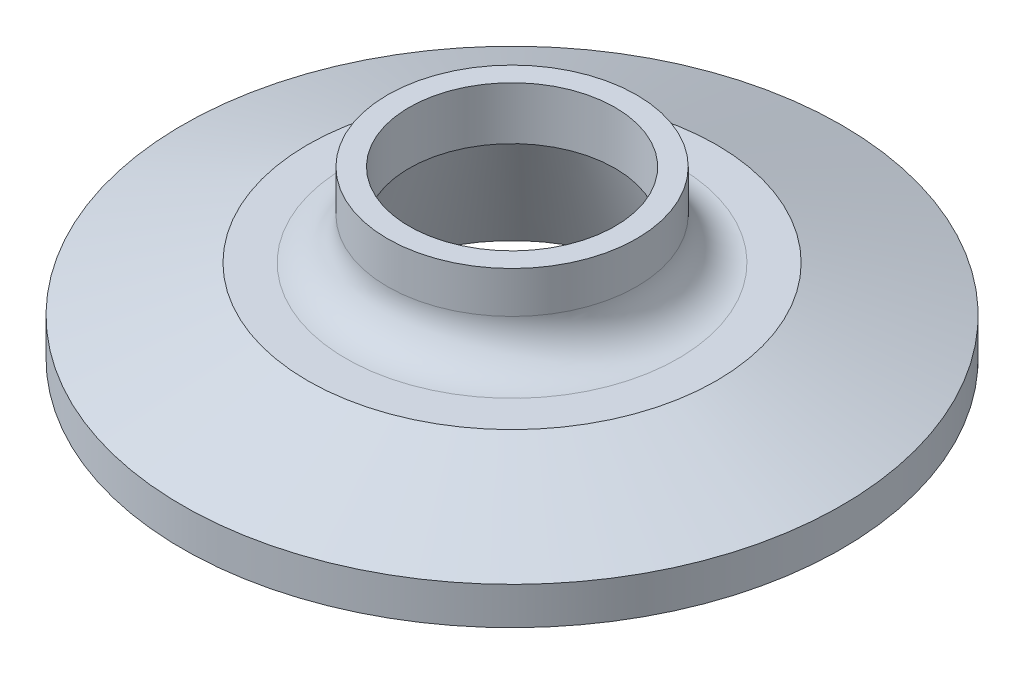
ISO-10303-21;
HEADER;
FILE_DESCRIPTION(('STEP AP214'),'2;1');
FILE_NAME('part.step','',(''),(''),'','','');
FILE_SCHEMA(('AUTOMOTIVE_DESIGN { 1 0 10303 214 1 1 1 1 }'));
ENDSEC;
DATA;
#1=APPLICATION_CONTEXT('core data for automotive mechanical design processes');
#2=APPLICATION_PROTOCOL_DEFINITION('international standard','automotive_design',2000,#1);
#3=PRODUCT_CONTEXT('',#1,'mechanical');
#4=PRODUCT('Part','Part','',(#3));
#5=PRODUCT_RELATED_PRODUCT_CATEGORY('part','',(#4));
#6=PRODUCT_DEFINITION_FORMATION('','',#4);
#7=PRODUCT_DEFINITION_CONTEXT('part definition',#1,'design');
#8=PRODUCT_DEFINITION('design','',#6,#7);
#9=PRODUCT_DEFINITION_SHAPE('','',#8);
#10=(LENGTH_UNIT() NAMED_UNIT(*) SI_UNIT(.MILLI.,.METRE.));
#11=(NAMED_UNIT(*) PLANE_ANGLE_UNIT() SI_UNIT($,.RADIAN.));
#12=(NAMED_UNIT(*) SI_UNIT($,.STERADIAN.) SOLID_ANGLE_UNIT());
#13=UNCERTAINTY_MEASURE_WITH_UNIT(LENGTH_MEASURE(1.E-05),#10,'distance_accuracy_value','');
#14=(GEOMETRIC_REPRESENTATION_CONTEXT(3) GLOBAL_UNCERTAINTY_ASSIGNED_CONTEXT((#13)) GLOBAL_UNIT_ASSIGNED_CONTEXT((#10,
#11,#12)) REPRESENTATION_CONTEXT('',''));
#15=CARTESIAN_POINT('',(0.,0.,0.));
#16=DIRECTION('',(0.,0.,1.));
#17=DIRECTION('',(1.,0.,0.));
#18=AXIS2_PLACEMENT_3D('',#15,#16,#17);
#19=CARTESIAN_POINT('',(-7.874,12.7,0.));
#20=DIRECTION('',(0.,-1.,0.));
#21=DIRECTION('',(0.,0.,-1.));
#22=AXIS2_PLACEMENT_3D('',#19,#20,#21);
#23=PLANE('',#22);
#24=CARTESIAN_POINT('',(0.,12.7,0.));
#25=DIRECTION('',(0.,-1.,0.));
#26=DIRECTION('',(0.,0.,-1.));
#27=AXIS2_PLACEMENT_3D('',#24,#25,#26);
#28=CIRCLE('',#27,9.525);
#29=CARTESIAN_POINT('',(0.,12.7,-9.525));
#30=VERTEX_POINT('',#29);
#31=EDGE_CURVE('E12',#30,#30,#28,.T.);
#32=ORIENTED_EDGE('',*,*,#31,.F.);
#33=EDGE_LOOP('',(#32));
#34=FACE_BOUND('',#33,.T.);
#35=CARTESIAN_POINT('',(0.,12.7,0.));
#36=DIRECTION('',(0.,-1.,0.));
#37=DIRECTION('',(0.,0.,-1.));
#38=AXIS2_PLACEMENT_3D('',#35,#36,#37);
#39=CIRCLE('',#38,7.874);
#40=CARTESIAN_POINT('',(0.,12.7,-7.874));
#41=VERTEX_POINT('',#40);
#42=EDGE_CURVE('E87',#41,#41,#39,.T.);
#43=ORIENTED_EDGE('',*,*,#42,.T.);
#44=EDGE_LOOP('',(#43));
#45=FACE_BOUND('',#44,.T.);
#46=ADVANCED_FACE('F38',(#34,#45),#23,.F.);
#47=CARTESIAN_POINT('',(0.,0.,0.));
#48=DIRECTION('',(0.,-1.,0.));
#49=DIRECTION('',(0.,0.,-1.));
#50=AXIS2_PLACEMENT_3D('',#47,#48,#49);
#51=CYLINDRICAL_SURFACE('',#50,9.525);
#52=CARTESIAN_POINT('',(0.,9.525,0.));
#53=DIRECTION('',(0.,-1.,0.));
#54=DIRECTION('',(0.,0.,-1.));
#55=AXIS2_PLACEMENT_3D('',#52,#53,#54);
#56=CIRCLE('',#55,9.525);
#57=CARTESIAN_POINT('',(0.,9.525,-9.525));
#58=VERTEX_POINT('',#57);
#59=EDGE_CURVE('E44',#58,#58,#56,.T.);
#60=ORIENTED_EDGE('',*,*,#59,.F.);
#61=EDGE_LOOP('',(#60));
#62=FACE_BOUND('',#61,.T.);
#63=ORIENTED_EDGE('',*,*,#31,.T.);
#64=EDGE_LOOP('',(#63));
#65=FACE_BOUND('',#64,.T.);
#66=ADVANCED_FACE('F166',(#62,#65),#51,.T.);
#67=CARTESIAN_POINT('',(0.,9.525,0.));
#68=DIRECTION('',(0.,-1.,0.));
#69=DIRECTION('',(0.,0.,-1.));
#70=AXIS2_PLACEMENT_3D('',#67,#68,#69);
#71=TOROIDAL_SURFACE('',#70,12.7,3.175);
#72=CARTESIAN_POINT('',(0.,6.35,0.));
#73=DIRECTION('',(0.,-1.,0.));
#74=DIRECTION('',(0.,0.,-1.));
#75=AXIS2_PLACEMENT_3D('',#72,#73,#74);
#76=CIRCLE('',#75,12.7);
#77=CARTESIAN_POINT('',(0.,6.35,-12.7));
#78=VERTEX_POINT('',#77);
#79=EDGE_CURVE('E48',#78,#78,#76,.T.);
#80=ORIENTED_EDGE('',*,*,#79,.F.);
#81=EDGE_LOOP('',(#80));
#82=FACE_BOUND('',#81,.T.);
#83=ORIENTED_EDGE('',*,*,#59,.T.);
#84=EDGE_LOOP('',(#83));
#85=FACE_BOUND('',#84,.T.);
#86=ADVANCED_FACE('F161',(#82,#85),#71,.F.);
#87=CARTESIAN_POINT('',(-12.7,6.35,0.));
#88=DIRECTION('',(0.,-1.,0.));
#89=DIRECTION('',(0.,0.,-1.));
#90=AXIS2_PLACEMENT_3D('',#87,#88,#89);
#91=PLANE('',#90);
#92=CARTESIAN_POINT('',(0.,6.35,0.));
#93=DIRECTION('',(0.,-1.,0.));
#94=DIRECTION('',(0.,0.,-1.));
#95=AXIS2_PLACEMENT_3D('',#92,#93,#94);
#96=CIRCLE('',#95,15.6301961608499);
#97=CARTESIAN_POINT('',(0.,6.35,-15.6301961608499));
#98=VERTEX_POINT('',#97);
#99=EDGE_CURVE('E52',#98,#98,#96,.T.);
#100=ORIENTED_EDGE('',*,*,#99,.F.);
#101=EDGE_LOOP('',(#100));
#102=FACE_BOUND('',#101,.T.);
#103=ORIENTED_EDGE('',*,*,#79,.T.);
#104=EDGE_LOOP('',(#103));
#105=FACE_BOUND('',#104,.T.);
#106=ADVANCED_FACE('F155',(#102,#105),#91,.F.);
#107=CARTESIAN_POINT('',(0.,6.35,0.));
#108=DIRECTION('',(0.,-1.,0.));
#109=DIRECTION('',(0.,0.,-1.));
#110=AXIS2_PLACEMENT_3D('',#107,#108,#109);
#111=CONICAL_SURFACE('',#110,15.6301961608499,1.22173047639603);
#112=CARTESIAN_POINT('',(0.,2.86804095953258,0.));
#113=DIRECTION('',(0.,-1.,0.));
#114=DIRECTION('',(0.,0.,-1.));
#115=AXIS2_PLACEMENT_3D('',#112,#113,#114);
#116=CIRCLE('',#115,25.1968);
#117=CARTESIAN_POINT('',(0.,2.86804095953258,-25.1968));
#118=VERTEX_POINT('',#117);
#119=EDGE_CURVE('E57',#118,#118,#116,.T.);
#120=ORIENTED_EDGE('',*,*,#119,.F.);
#121=EDGE_LOOP('',(#120));
#122=FACE_BOUND('',#121,.T.);
#123=ORIENTED_EDGE('',*,*,#99,.T.);
#124=EDGE_LOOP('',(#123));
#125=FACE_BOUND('',#124,.T.);
#126=ADVANCED_FACE('F149',(#122,#125),#111,.T.);
#127=CARTESIAN_POINT('',(0.,0.,0.));
#128=DIRECTION('',(0.,-1.,0.));
#129=DIRECTION('',(0.,0.,-1.));
#130=AXIS2_PLACEMENT_3D('',#127,#128,#129);
#131=CYLINDRICAL_SURFACE('',#130,25.1968);
#132=CARTESIAN_POINT('',(0.,0.,0.));
#133=DIRECTION('',(0.,-1.,0.));
#134=DIRECTION('',(0.,0.,-1.));
#135=AXIS2_PLACEMENT_3D('',#132,#133,#134);
#136=CIRCLE('',#135,25.1968);
#137=CARTESIAN_POINT('',(0.,0.,-25.1968));
#138=VERTEX_POINT('',#137);
#139=EDGE_CURVE('E60',#138,#138,#136,.T.);
#140=ORIENTED_EDGE('',*,*,#139,.F.);
#141=EDGE_LOOP('',(#140));
#142=FACE_BOUND('',#141,.T.);
#143=ORIENTED_EDGE('',*,*,#119,.T.);
#144=EDGE_LOOP('',(#143));
#145=FACE_BOUND('',#144,.T.);
#146=ADVANCED_FACE('F143',(#142,#145),#131,.T.);
#147=CARTESIAN_POINT('',(-25.1968,0.,0.));
#148=DIRECTION('',(0.,1.,0.));
#149=DIRECTION('',(0.,0.,1.));
#150=AXIS2_PLACEMENT_3D('',#147,#148,#149);
#151=PLANE('',#150);
#152=CARTESIAN_POINT('',(0.,0.,0.));
#153=DIRECTION('',(0.,-1.,0.));
#154=DIRECTION('',(0.,0.,-1.));
#155=AXIS2_PLACEMENT_3D('',#152,#153,#154);
#156=CIRCLE('',#155,23.8091722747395);
#157=CARTESIAN_POINT('',(0.,0.,-23.8091722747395));
#158=VERTEX_POINT('',#157);
#159=EDGE_CURVE('E63',#158,#158,#156,.T.);
#160=ORIENTED_EDGE('',*,*,#159,.F.);
#161=EDGE_LOOP('',(#160));
#162=FACE_BOUND('',#161,.T.);
#163=ORIENTED_EDGE('',*,*,#139,.T.);
#164=EDGE_LOOP('',(#163));
#165=FACE_BOUND('',#164,.T.);
#166=ADVANCED_FACE('F137',(#162,#165),#151,.F.);
#167=CARTESIAN_POINT('',(0.,0.787400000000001,0.));
#168=DIRECTION('',(0.,-1.,0.));
#169=DIRECTION('',(0.,0.,-1.));
#170=AXIS2_PLACEMENT_3D('',#167,#168,#169);
#171=TOROIDAL_SURFACE('',#170,23.8091722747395,0.787399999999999);
#172=CARTESIAN_POINT('',(0.,0.479738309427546,0.));
#173=DIRECTION('',(0.,-1.,0.));
#174=DIRECTION('',(0.,0.,-1.));
#175=AXIS2_PLACEMENT_3D('',#172,#173,#174);
#176=CIRCLE('',#175,23.0843667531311);
#177=CARTESIAN_POINT('',(0.,0.479738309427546,-23.0843667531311));
#178=VERTEX_POINT('',#177);
#179=EDGE_CURVE('E66',#178,#178,#176,.T.);
#180=ORIENTED_EDGE('',*,*,#179,.F.);
#181=EDGE_LOOP('',(#180));
#182=FACE_BOUND('',#181,.T.);
#183=ORIENTED_EDGE('',*,*,#159,.T.);
#184=EDGE_LOOP('',(#183));
#185=FACE_BOUND('',#184,.T.);
#186=ADVANCED_FACE('F131',(#182,#185),#171,.T.);
#187=CARTESIAN_POINT('',(0.,0.479738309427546,0.));
#188=DIRECTION('',(0.,-1.,0.));
#189=DIRECTION('',(0.,0.,-1.));
#190=AXIS2_PLACEMENT_3D('',#187,#188,#189);
#191=CONICAL_SURFACE('',#190,23.0843667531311,0.401425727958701);
#192=CARTESIAN_POINT('',(0.,0.8728548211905,0.));
#193=DIRECTION('',(0.,-1.,0.));
#194=DIRECTION('',(0.,0.,-1.));
#195=AXIS2_PLACEMENT_3D('',#192,#193,#194);
#196=CIRCLE('',#195,22.9174986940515);
#197=CARTESIAN_POINT('',(0.,0.8728548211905,-22.9174986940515));
#198=VERTEX_POINT('',#197);
#199=EDGE_CURVE('E69',#198,#198,#196,.T.);
#200=ORIENTED_EDGE('',*,*,#199,.F.);
#201=EDGE_LOOP('',(#200));
#202=FACE_BOUND('',#201,.T.);
#203=ORIENTED_EDGE('',*,*,#179,.T.);
#204=EDGE_LOOP('',(#203));
#205=FACE_BOUND('',#204,.T.);
#206=ADVANCED_FACE('F125',(#202,#205),#191,.F.);
#207=CARTESIAN_POINT('',(0.,0.406400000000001,0.));
#208=DIRECTION('',(0.,-1.,0.));
#209=DIRECTION('',(0.,0.,-1.));
#210=AXIS2_PLACEMENT_3D('',#207,#208,#209);
#211=TOROIDAL_SURFACE('',#210,21.8186,1.1938);
#212=CARTESIAN_POINT('',(0.,0.872854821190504,0.));
#213=DIRECTION('',(0.,-1.,0.));
#214=DIRECTION('',(0.,0.,-1.));
#215=AXIS2_PLACEMENT_3D('',#212,#213,#214);
#216=CIRCLE('',#215,20.7197013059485);
#217=CARTESIAN_POINT('',(0.,0.872854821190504,-20.7197013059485));
#218=VERTEX_POINT('',#217);
#219=EDGE_CURVE('E72',#218,#218,#216,.T.);
#220=ORIENTED_EDGE('',*,*,#219,.F.);
#221=EDGE_LOOP('',(#220));
#222=FACE_BOUND('',#221,.T.);
#223=ORIENTED_EDGE('',*,*,#199,.T.);
#224=EDGE_LOOP('',(#223));
#225=FACE_BOUND('',#224,.T.);
#226=ADVANCED_FACE('F119',(#222,#225),#211,.F.);
#227=CARTESIAN_POINT('',(0.,0.872854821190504,0.));
#228=DIRECTION('',(0.,1.,0.));
#229=DIRECTION('',(0.,0.,1.));
#230=AXIS2_PLACEMENT_3D('',#227,#228,#229);
#231=CONICAL_SURFACE('',#230,20.7197013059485,0.401425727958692);
#232=CARTESIAN_POINT('',(0.,0.479738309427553,0.));
#233=DIRECTION('',(0.,-1.,0.));
#234=DIRECTION('',(0.,0.,-1.));
#235=AXIS2_PLACEMENT_3D('',#232,#233,#234);
#236=CIRCLE('',#235,20.5528332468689);
#237=CARTESIAN_POINT('',(0.,0.479738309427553,-20.5528332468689));
#238=VERTEX_POINT('',#237);
#239=EDGE_CURVE('E75',#238,#238,#236,.T.);
#240=ORIENTED_EDGE('',*,*,#239,.F.);
#241=EDGE_LOOP('',(#240));
#242=FACE_BOUND('',#241,.T.);
#243=ORIENTED_EDGE('',*,*,#219,.T.);
#244=EDGE_LOOP('',(#243));
#245=FACE_BOUND('',#244,.T.);
#246=ADVANCED_FACE('F113',(#242,#245),#231,.T.);
#247=CARTESIAN_POINT('',(0.,0.787400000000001,0.));
#248=DIRECTION('',(0.,-1.,0.));
#249=DIRECTION('',(0.,0.,-1.));
#250=AXIS2_PLACEMENT_3D('',#247,#248,#249);
#251=TOROIDAL_SURFACE('',#250,19.8280277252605,0.787399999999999);
#252=CARTESIAN_POINT('',(0.,0.,0.));
#253=DIRECTION('',(0.,-1.,0.));
#254=DIRECTION('',(0.,0.,-1.));
#255=AXIS2_PLACEMENT_3D('',#252,#253,#254);
#256=CIRCLE('',#255,19.8280277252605);
#257=CARTESIAN_POINT('',(0.,0.,-19.8280277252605));
#258=VERTEX_POINT('',#257);
#259=EDGE_CURVE('E78',#258,#258,#256,.T.);
#260=ORIENTED_EDGE('',*,*,#259,.F.);
#261=EDGE_LOOP('',(#260));
#262=FACE_BOUND('',#261,.T.);
#263=ORIENTED_EDGE('',*,*,#239,.T.);
#264=EDGE_LOOP('',(#263));
#265=FACE_BOUND('',#264,.T.);
#266=ADVANCED_FACE('F107',(#262,#265),#251,.T.);
#267=CARTESIAN_POINT('',(-19.8280277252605,0.,0.));
#268=DIRECTION('',(0.,1.,0.));
#269=DIRECTION('',(0.,0.,1.));
#270=AXIS2_PLACEMENT_3D('',#267,#268,#269);
#271=PLANE('',#270);
#272=CARTESIAN_POINT('',(0.,0.,0.));
#273=DIRECTION('',(0.,-1.,0.));
#274=DIRECTION('',(0.,0.,-1.));
#275=AXIS2_PLACEMENT_3D('',#272,#273,#274);
#276=CIRCLE('',#275,11.049);
#277=CARTESIAN_POINT('',(0.,0.,-11.049));
#278=VERTEX_POINT('',#277);
#279=EDGE_CURVE('E81',#278,#278,#276,.T.);
#280=ORIENTED_EDGE('',*,*,#279,.F.);
#281=EDGE_LOOP('',(#280));
#282=FACE_BOUND('',#281,.T.);
#283=ORIENTED_EDGE('',*,*,#259,.T.);
#284=EDGE_LOOP('',(#283));
#285=FACE_BOUND('',#284,.T.);
#286=ADVANCED_FACE('F101',(#282,#285),#271,.F.);
#287=CARTESIAN_POINT('',(0.,0.,0.));
#288=DIRECTION('',(0.,-1.,0.));
#289=DIRECTION('',(0.,0.,-1.));
#290=AXIS2_PLACEMENT_3D('',#287,#288,#289);
#291=CONICAL_SURFACE('',#290,11.049,0.35116024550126);
#292=CARTESIAN_POINT('',(0.,8.66672008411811,0.));
#293=DIRECTION('',(0.,-1.,0.));
#294=DIRECTION('',(0.,0.,-1.));
#295=AXIS2_PLACEMENT_3D('',#292,#293,#294);
#296=CIRCLE('',#295,7.874);
#297=CARTESIAN_POINT('',(0.,8.66672008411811,-7.874));
#298=VERTEX_POINT('',#297);
#299=EDGE_CURVE('E84',#298,#298,#296,.T.);
#300=ORIENTED_EDGE('',*,*,#299,.F.);
#301=EDGE_LOOP('',(#300));
#302=FACE_BOUND('',#301,.T.);
#303=ORIENTED_EDGE('',*,*,#279,.T.);
#304=EDGE_LOOP('',(#303));
#305=FACE_BOUND('',#304,.T.);
#306=ADVANCED_FACE('F95',(#302,#305),#291,.F.);
#307=CARTESIAN_POINT('',(0.,0.,0.));
#308=DIRECTION('',(0.,-1.,0.));
#309=DIRECTION('',(0.,0.,-1.));
#310=AXIS2_PLACEMENT_3D('',#307,#308,#309);
#311=CYLINDRICAL_SURFACE('',#310,7.874);
#312=ORIENTED_EDGE('',*,*,#42,.F.);
#313=EDGE_LOOP('',(#312));
#314=FACE_BOUND('',#313,.T.);
#315=ORIENTED_EDGE('',*,*,#299,.T.);
#316=EDGE_LOOP('',(#315));
#317=FACE_BOUND('',#316,.T.);
#318=ADVANCED_FACE('F92',(#314,#317),#311,.F.);
#319=CLOSED_SHELL('',(#46,#66,#86,#106,#126,#146,#166,#186,#206,#226,#246,#266,#286,#306,#318));
#320=MANIFOLD_SOLID_BREP('B2',#319);
#321=ADVANCED_BREP_SHAPE_REPRESENTATION('',(#18,#320),#14);
#322=SHAPE_DEFINITION_REPRESENTATION(#9,#321);
ENDSEC;
END-ISO-10303-21;
